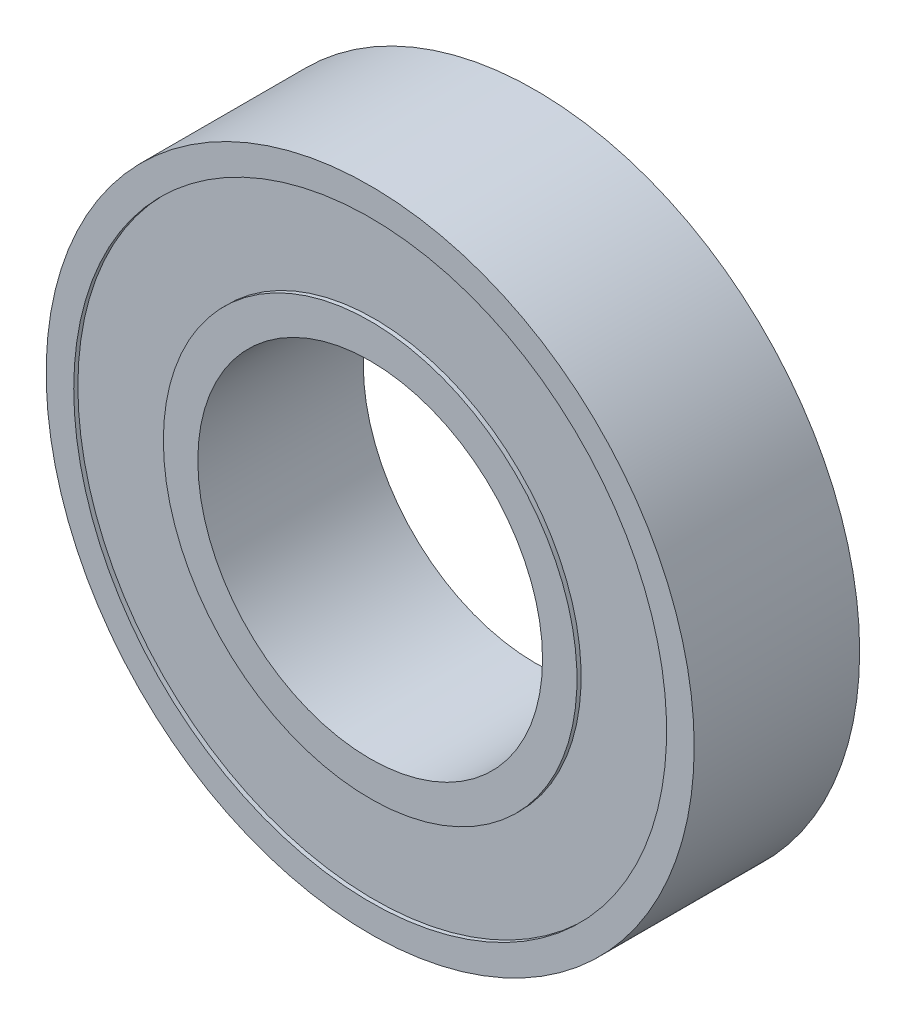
ISO-10303-21;
HEADER;
FILE_DESCRIPTION(('STEP AP214'),'2;1');
FILE_NAME('part.step','',(''),(''),'','','');
FILE_SCHEMA(('AUTOMOTIVE_DESIGN { 1 0 10303 214 1 1 1 1 }'));
ENDSEC;
DATA;
#1=APPLICATION_CONTEXT('core data for automotive mechanical design processes');
#2=APPLICATION_PROTOCOL_DEFINITION('international standard','automotive_design',2000,#1);
#3=PRODUCT_CONTEXT('',#1,'mechanical');
#4=PRODUCT('Part','Part','',(#3));
#5=PRODUCT_RELATED_PRODUCT_CATEGORY('part','',(#4));
#6=PRODUCT_DEFINITION_FORMATION('','',#4);
#7=PRODUCT_DEFINITION_CONTEXT('part definition',#1,'design');
#8=PRODUCT_DEFINITION('design','',#6,#7);
#9=PRODUCT_DEFINITION_SHAPE('','',#8);
#10=(LENGTH_UNIT() NAMED_UNIT(*) SI_UNIT(.MILLI.,.METRE.));
#11=(NAMED_UNIT(*) PLANE_ANGLE_UNIT() SI_UNIT($,.RADIAN.));
#12=(NAMED_UNIT(*) SI_UNIT($,.STERADIAN.) SOLID_ANGLE_UNIT());
#13=UNCERTAINTY_MEASURE_WITH_UNIT(LENGTH_MEASURE(1.E-05),#10,'distance_accuracy_value','');
#14=(GEOMETRIC_REPRESENTATION_CONTEXT(3) GLOBAL_UNCERTAINTY_ASSIGNED_CONTEXT((#13)) GLOBAL_UNIT_ASSIGNED_CONTEXT((#10,
#11,#12)) REPRESENTATION_CONTEXT('',''));
#15=CARTESIAN_POINT('',(0.,0.,0.));
#16=DIRECTION('',(0.,0.,1.));
#17=DIRECTION('',(1.,0.,0.));
#18=AXIS2_PLACEMENT_3D('',#15,#16,#17);
#19=CARTESIAN_POINT('',(-16.5819565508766,-11.1817024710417,0.));
#20=DIRECTION('',(0.,0.,1.));
#21=DIRECTION('',(1.,0.,0.));
#22=AXIS2_PLACEMENT_3D('',#19,#20,#21);
#23=CYLINDRICAL_SURFACE('',#22,12.5);
#24=CARTESIAN_POINT('',(-16.5819565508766,-11.1817024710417,0.));
#25=DIRECTION('',(0.,0.,1.));
#26=DIRECTION('',(1.,0.,0.));
#27=AXIS2_PLACEMENT_3D('',#24,#25,#26);
#28=CIRCLE('',#27,12.5);
#29=CARTESIAN_POINT('',(-4.08195655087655,-11.1817024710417,0.));
#30=VERTEX_POINT('',#29);
#31=EDGE_CURVE('E52',#30,#30,#28,.T.);
#32=ORIENTED_EDGE('',*,*,#31,.F.);
#33=EDGE_LOOP('',(#32));
#34=FACE_BOUND('',#33,.T.);
#35=CARTESIAN_POINT('',(-16.5819565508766,-11.1817024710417,12.));
#36=DIRECTION('',(0.,0.,1.));
#37=DIRECTION('',(1.,0.,0.));
#38=AXIS2_PLACEMENT_3D('',#35,#36,#37);
#39=CIRCLE('',#38,12.5);
#40=CARTESIAN_POINT('',(-4.08195655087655,-11.1817024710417,12.));
#41=VERTEX_POINT('',#40);
#42=EDGE_CURVE('E18',#41,#41,#39,.T.);
#43=ORIENTED_EDGE('',*,*,#42,.T.);
#44=EDGE_LOOP('',(#43));
#45=FACE_BOUND('',#44,.T.);
#46=ADVANCED_FACE('F14',(#34,#45),#23,.F.);
#47=CARTESIAN_POINT('',(-16.5819565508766,-11.1817024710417,12.));
#48=DIRECTION('',(0.,0.,-1.));
#49=DIRECTION('',(-1.,0.,0.));
#50=AXIS2_PLACEMENT_3D('',#47,#48,#49);
#51=PLANE('',#50);
#52=ORIENTED_EDGE('',*,*,#42,.F.);
#53=EDGE_LOOP('',(#52));
#54=FACE_BOUND('',#53,.T.);
#55=CARTESIAN_POINT('',(-16.5819565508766,-11.1817024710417,12.));
#56=DIRECTION('',(0.,0.,-1.));
#57=DIRECTION('',(-1.,0.,0.));
#58=AXIS2_PLACEMENT_3D('',#55,#56,#57);
#59=CIRCLE('',#58,15.);
#60=CARTESIAN_POINT('',(-31.5819565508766,-11.1817024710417,12.));
#61=VERTEX_POINT('',#60);
#62=EDGE_CURVE('E50',#61,#61,#59,.T.);
#63=ORIENTED_EDGE('',*,*,#62,.F.);
#64=EDGE_LOOP('',(#63));
#65=FACE_BOUND('',#64,.T.);
#66=ADVANCED_FACE('F60',(#54,#65),#51,.F.);
#67=CARTESIAN_POINT('',(-16.5819565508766,-11.1817024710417,0.));
#68=DIRECTION('',(0.,0.,-1.));
#69=DIRECTION('',(-1.,0.,0.));
#70=AXIS2_PLACEMENT_3D('',#67,#68,#69);
#71=PLANE('',#70);
#72=ORIENTED_EDGE('',*,*,#31,.T.);
#73=EDGE_LOOP('',(#72));
#74=FACE_BOUND('',#73,.T.);
#75=CARTESIAN_POINT('',(-16.5819565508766,-11.1817024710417,0.));
#76=DIRECTION('',(0.,0.,1.));
#77=DIRECTION('',(1.,0.,0.));
#78=AXIS2_PLACEMENT_3D('',#75,#76,#77);
#79=CIRCLE('',#78,15.);
#80=CARTESIAN_POINT('',(-1.58195655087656,-11.1817024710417,0.));
#81=VERTEX_POINT('',#80);
#82=EDGE_CURVE('E47',#81,#81,#79,.T.);
#83=ORIENTED_EDGE('',*,*,#82,.F.);
#84=EDGE_LOOP('',(#83));
#85=FACE_BOUND('',#84,.T.);
#86=ADVANCED_FACE('F63',(#74,#85),#71,.T.);
#87=CARTESIAN_POINT('',(-16.5819565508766,-11.1817024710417,12.));
#88=DIRECTION('',(0.,0.,-1.));
#89=DIRECTION('',(-1.,0.,0.));
#90=AXIS2_PLACEMENT_3D('',#87,#88,#89);
#91=CYLINDRICAL_SURFACE('',#90,15.);
#92=ORIENTED_EDGE('',*,*,#62,.T.);
#93=EDGE_LOOP('',(#92));
#94=FACE_BOUND('',#93,.T.);
#95=CARTESIAN_POINT('',(-16.5819565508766,-11.1817024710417,11.7));
#96=DIRECTION('',(0.,0.,-1.));
#97=DIRECTION('',(-1.,0.,0.));
#98=AXIS2_PLACEMENT_3D('',#95,#96,#97);
#99=CIRCLE('',#98,15.);
#100=CARTESIAN_POINT('',(-31.5819565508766,-11.1817024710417,11.7));
#101=VERTEX_POINT('',#100);
#102=EDGE_CURVE('E44',#101,#101,#99,.F.);
#103=ORIENTED_EDGE('',*,*,#102,.T.);
#104=EDGE_LOOP('',(#103));
#105=FACE_BOUND('',#104,.T.);
#106=ADVANCED_FACE('F67',(#94,#105),#91,.T.);
#107=CARTESIAN_POINT('',(-16.5819565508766,-11.1817024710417,0.));
#108=DIRECTION('',(0.,0.,1.));
#109=DIRECTION('',(1.,0.,0.));
#110=AXIS2_PLACEMENT_3D('',#107,#108,#109);
#111=CYLINDRICAL_SURFACE('',#110,15.);
#112=ORIENTED_EDGE('',*,*,#82,.T.);
#113=EDGE_LOOP('',(#112));
#114=FACE_BOUND('',#113,.T.);
#115=CARTESIAN_POINT('',(-16.5819565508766,-11.1817024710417,0.3));
#116=DIRECTION('',(0.,0.,1.));
#117=DIRECTION('',(1.,0.,0.));
#118=AXIS2_PLACEMENT_3D('',#115,#116,#117);
#119=CIRCLE('',#118,15.);
#120=CARTESIAN_POINT('',(-1.58195655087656,-11.1817024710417,0.3));
#121=VERTEX_POINT('',#120);
#122=EDGE_CURVE('E41',#121,#121,#119,.F.);
#123=ORIENTED_EDGE('',*,*,#122,.T.);
#124=EDGE_LOOP('',(#123));
#125=FACE_BOUND('',#124,.T.);
#126=ADVANCED_FACE('F70',(#114,#125),#111,.T.);
#127=CARTESIAN_POINT('',(-16.5819565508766,-11.1817024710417,11.7));
#128=DIRECTION('',(0.,0.,-1.));
#129=DIRECTION('',(-1.,0.,0.));
#130=AXIS2_PLACEMENT_3D('',#127,#128,#129);
#131=PLANE('',#130);
#132=ORIENTED_EDGE('',*,*,#102,.F.);
#133=EDGE_LOOP('',(#132));
#134=FACE_BOUND('',#133,.T.);
#135=CARTESIAN_POINT('',(-16.5819565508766,-11.1817024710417,11.7));
#136=DIRECTION('',(0.,0.,-1.));
#137=DIRECTION('',(-1.,0.,0.));
#138=AXIS2_PLACEMENT_3D('',#135,#136,#137);
#139=CIRCLE('',#138,21.5);
#140=CARTESIAN_POINT('',(-38.0819565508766,-11.1817024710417,11.7));
#141=VERTEX_POINT('',#140);
#142=EDGE_CURVE('E38',#141,#141,#139,.F.);
#143=ORIENTED_EDGE('',*,*,#142,.T.);
#144=EDGE_LOOP('',(#143));
#145=FACE_BOUND('',#144,.T.);
#146=ADVANCED_FACE('F74',(#134,#145),#131,.F.);
#147=CARTESIAN_POINT('',(5.34804344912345,10.7482975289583,0.3));
#148=DIRECTION('',(0.,0.,1.));
#149=DIRECTION('',(-1.,0.,0.));
#150=AXIS2_PLACEMENT_3D('',#147,#148,#149);
#151=PLANE('',#150);
#152=ORIENTED_EDGE('',*,*,#122,.F.);
#153=EDGE_LOOP('',(#152));
#154=FACE_BOUND('',#153,.T.);
#155=CARTESIAN_POINT('',(-16.5819565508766,-11.1817024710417,0.3));
#156=DIRECTION('',(0.,0.,1.));
#157=DIRECTION('',(1.,0.,0.));
#158=AXIS2_PLACEMENT_3D('',#155,#156,#157);
#159=CIRCLE('',#158,21.5);
#160=CARTESIAN_POINT('',(4.91804344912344,-11.1817024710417,0.3));
#161=VERTEX_POINT('',#160);
#162=EDGE_CURVE('E35',#161,#161,#159,.F.);
#163=ORIENTED_EDGE('',*,*,#162,.T.);
#164=EDGE_LOOP('',(#163));
#165=FACE_BOUND('',#164,.T.);
#166=ADVANCED_FACE('F77',(#154,#165),#151,.F.);
#167=CARTESIAN_POINT('',(-16.5819565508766,-11.1817024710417,12.));
#168=DIRECTION('',(0.,0.,-1.));
#169=DIRECTION('',(-1.,0.,0.));
#170=AXIS2_PLACEMENT_3D('',#167,#168,#169);
#171=CYLINDRICAL_SURFACE('',#170,21.5);
#172=CARTESIAN_POINT('',(-16.5819565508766,-11.1817024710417,12.));
#173=DIRECTION('',(0.,0.,-1.));
#174=DIRECTION('',(-1.,0.,0.));
#175=AXIS2_PLACEMENT_3D('',#172,#173,#174);
#176=CIRCLE('',#175,21.5);
#177=CARTESIAN_POINT('',(-38.0819565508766,-11.1817024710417,12.));
#178=VERTEX_POINT('',#177);
#179=EDGE_CURVE('E32',#178,#178,#176,.F.);
#180=ORIENTED_EDGE('',*,*,#179,.T.);
#181=EDGE_LOOP('',(#180));
#182=FACE_BOUND('',#181,.T.);
#183=ORIENTED_EDGE('',*,*,#142,.F.);
#184=EDGE_LOOP('',(#183));
#185=FACE_BOUND('',#184,.T.);
#186=ADVANCED_FACE('F81',(#182,#185),#171,.F.);
#187=CARTESIAN_POINT('',(-16.5819565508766,-11.1817024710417,0.));
#188=DIRECTION('',(0.,0.,1.));
#189=DIRECTION('',(1.,0.,0.));
#190=AXIS2_PLACEMENT_3D('',#187,#188,#189);
#191=CYLINDRICAL_SURFACE('',#190,21.5);
#192=CARTESIAN_POINT('',(-16.5819565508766,-11.1817024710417,0.));
#193=DIRECTION('',(0.,0.,1.));
#194=DIRECTION('',(1.,0.,0.));
#195=AXIS2_PLACEMENT_3D('',#192,#193,#194);
#196=CIRCLE('',#195,21.5);
#197=CARTESIAN_POINT('',(4.91804344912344,-11.1817024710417,0.));
#198=VERTEX_POINT('',#197);
#199=EDGE_CURVE('E27',#198,#198,#196,.T.);
#200=ORIENTED_EDGE('',*,*,#199,.F.);
#201=EDGE_LOOP('',(#200));
#202=FACE_BOUND('',#201,.T.);
#203=ORIENTED_EDGE('',*,*,#162,.F.);
#204=EDGE_LOOP('',(#203));
#205=FACE_BOUND('',#204,.T.);
#206=ADVANCED_FACE('F16',(#202,#205),#191,.F.);
#207=CARTESIAN_POINT('',(-16.5819565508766,-11.1817024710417,12.));
#208=DIRECTION('',(0.,0.,-1.));
#209=DIRECTION('',(-1.,0.,0.));
#210=AXIS2_PLACEMENT_3D('',#207,#208,#209);
#211=PLANE('',#210);
#212=ORIENTED_EDGE('',*,*,#179,.F.);
#213=EDGE_LOOP('',(#212));
#214=FACE_BOUND('',#213,.T.);
#215=CARTESIAN_POINT('',(-16.5819565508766,-11.1817024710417,12.));
#216=DIRECTION('',(0.,0.,1.));
#217=DIRECTION('',(1.,0.,0.));
#218=AXIS2_PLACEMENT_3D('',#215,#216,#217);
#219=CIRCLE('',#218,23.5);
#220=CARTESIAN_POINT('',(6.91804344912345,-11.1817024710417,12.));
#221=VERTEX_POINT('',#220);
#222=EDGE_CURVE('E22',#221,#221,#219,.F.);
#223=ORIENTED_EDGE('',*,*,#222,.F.);
#224=EDGE_LOOP('',(#223));
#225=FACE_BOUND('',#224,.T.);
#226=ADVANCED_FACE('F90',(#214,#225),#211,.F.);
#227=CARTESIAN_POINT('',(-16.5819565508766,-11.1817024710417,0.));
#228=DIRECTION('',(0.,0.,-1.));
#229=DIRECTION('',(-1.,0.,0.));
#230=AXIS2_PLACEMENT_3D('',#227,#228,#229);
#231=PLANE('',#230);
#232=ORIENTED_EDGE('',*,*,#199,.T.);
#233=EDGE_LOOP('',(#232));
#234=FACE_BOUND('',#233,.T.);
#235=CARTESIAN_POINT('',(-16.5819565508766,-11.1817024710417,0.));
#236=DIRECTION('',(0.,0.,1.));
#237=DIRECTION('',(1.,0.,0.));
#238=AXIS2_PLACEMENT_3D('',#235,#236,#237);
#239=CIRCLE('',#238,23.5);
#240=CARTESIAN_POINT('',(6.91804344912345,-11.1817024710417,0.));
#241=VERTEX_POINT('',#240);
#242=EDGE_CURVE('E10',#241,#241,#239,.T.);
#243=ORIENTED_EDGE('',*,*,#242,.F.);
#244=EDGE_LOOP('',(#243));
#245=FACE_BOUND('',#244,.T.);
#246=ADVANCED_FACE('F96',(#234,#245),#231,.T.);
#247=CARTESIAN_POINT('',(-16.5819565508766,-11.1817024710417,0.));
#248=DIRECTION('',(0.,0.,1.));
#249=DIRECTION('',(1.,0.,0.));
#250=AXIS2_PLACEMENT_3D('',#247,#248,#249);
#251=CYLINDRICAL_SURFACE('',#250,23.5);
#252=ORIENTED_EDGE('',*,*,#242,.T.);
#253=EDGE_LOOP('',(#252));
#254=FACE_BOUND('',#253,.T.);
#255=ORIENTED_EDGE('',*,*,#222,.T.);
#256=EDGE_LOOP('',(#255));
#257=FACE_BOUND('',#256,.T.);
#258=ADVANCED_FACE('F94',(#254,#257),#251,.T.);
#259=CLOSED_SHELL('',(#46,#66,#86,#106,#126,#146,#166,#186,#206,#226,#246,#258));
#260=MANIFOLD_SOLID_BREP('B1',#259);
#261=ADVANCED_BREP_SHAPE_REPRESENTATION('',(#18,#260),#14);
#262=SHAPE_DEFINITION_REPRESENTATION(#9,#261);
ENDSEC;
END-ISO-10303-21;
